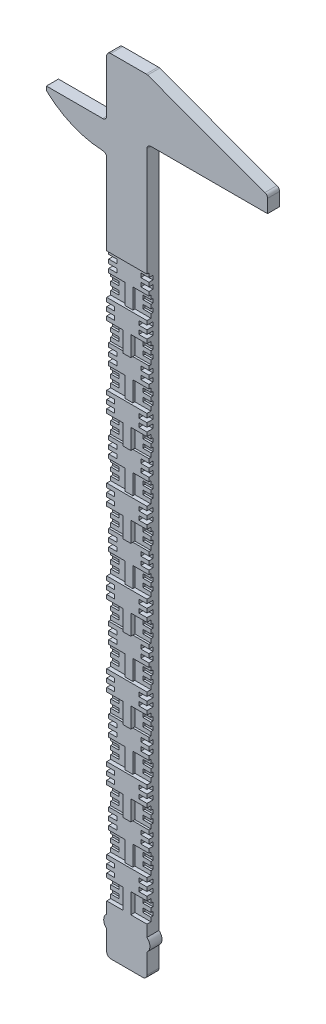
from build123d import *

# Parameters (mm, degrees)
BOSS_EXTRU_1_DEPTH      = 3
ESQUISSE3_W             = 3.5
ESQUISSE3_H             = 10
ENL_V_MAT_EXTRU_2_DEPTH = 10
ESQUISSE4_W             = 5.921927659
ESQUISSE4_H             = 5
ENL_V_MAT_EXTRU_3_DEPTH = 4
ESQUISSE5_W             = 8.496447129
ESQUISSE5_H             = 1
ENL_V_MAT_EXTRU_4_DEPTH = 2


with BuildPart() as part:
    # Esquisse1 → Boss.-Extru.1 (new body)
    with BuildSketch(Plane.XY):
        with BuildLine():
            Line((10.166700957, 14.938876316), (39.344254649, 4.240439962))
            ThreePointArc((39.344254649, 4.240439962), (39.819833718, 3.874165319), (40, 3.301563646))
            Line((40, 3.301563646), (40, 0))
            Line((40, 0), (11, 0))
            ThreePointArc((11, 0), (10.292893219, -0.292893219), (10, -1))
            Line((10, -1), (10, -170.877501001))
            ThreePointArc((10, -170.877501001), (10.75, -172.4387505), (10, -174))
            Line((10, -174), (10, -179))
            ThreePointArc((10, -179), (9.707106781, -179.707106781), (9, -180))
            Line((9, -180), (1, -180))
            ThreePointArc((1, -180), (0.292893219, -179.707106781), (0, -179))
            Line((0, -179), (0, -174))
            ThreePointArc((0, -174), (-0.75, -172.4387505), (0, -170.877501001))
            Line((0, -170.877501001), (0, -7.909897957))
            ThreePointArc((0, -7.909897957), (-0.277640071, -7.218380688), (-0.956392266, -6.910849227))
            ThreePointArc((-0.956392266, -6.910849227), (-8.508004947, -5.214199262), (-15, -1))
            Line((-15, -1), (-15, 0))
            Line((-15, 0), (-1, 0))
            ThreePointArc((-1, 0), (-0.292893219, 0.292893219), (0, 1))
            Line((0, 1), (0, 14))
            ThreePointArc((0, 14), (0.292893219, 14.707106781), (1, 15))
            Line((1, 15), (9.822446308, 15))
            ThreePointArc((9.822446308, 15), (9.997265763, 14.984600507), (10.166700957, 14.938876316))
        make_face()
    extrude(amount=BOSS_EXTRU_1_DEPTH)

    # Esquisse3 → Enl_v. mat.-Extru.2 (cut)
    with BuildSketch(Plane(origin=(10, 0, 0), x_dir=(0, 0, -1), z_dir=(1, 0, 0))):
        with Locations((-4.25, -33.014321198)):
            Rectangle(ESQUISSE3_W, ESQUISSE3_H)
        with Locations((-4.25, -53.014321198)):
            Rectangle(ESQUISSE3_W, ESQUISSE3_H)
        with Locations((-4.25, -73.014321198)):
            Rectangle(ESQUISSE3_W, ESQUISSE3_H)
        with Locations((-4.25, -93.014321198)):
            Rectangle(ESQUISSE3_W, ESQUISSE3_H)
        with Locations((-4.25, -113.014321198)):
            Rectangle(ESQUISSE3_W, ESQUISSE3_H)
        with Locations((-4.25, -133.014321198)):
            Rectangle(ESQUISSE3_W, ESQUISSE3_H)
        with Locations((-4.25, -153.014321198)):
            Rectangle(ESQUISSE3_W, ESQUISSE3_H)
    extrude(amount=-ENL_V_MAT_EXTRU_2_DEPTH, mode=Mode.SUBTRACT)

    # Esquisse4 → Enl_v. mat.-Extru.3 (cut)
    with BuildSketch(Plane(origin=(10, 0, 0), x_dir=(0, 0, -1), z_dir=(1, 0, 0))):
        with Locations((-4.96096383, -35.514321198)):
            Rectangle(ESQUISSE4_W, ESQUISSE4_H)
        with Locations((-4.96096383, -45.514321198)):
            Rectangle(ESQUISSE4_W, ESQUISSE4_H)
        with Locations((-4.96096383, -55.514321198)):
            Rectangle(ESQUISSE4_W, ESQUISSE4_H)
        with Locations((-4.96096383, -65.514321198)):
            Rectangle(ESQUISSE4_W, ESQUISSE4_H)
        with Locations((-4.96096383, -75.514321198)):
            Rectangle(ESQUISSE4_W, ESQUISSE4_H)
        with Locations((-4.96096383, -85.514321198)):
            Rectangle(ESQUISSE4_W, ESQUISSE4_H)
        with Locations((-4.96096383, -95.514321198)):
            Rectangle(ESQUISSE4_W, ESQUISSE4_H)
        with Locations((-4.96096383, -105.514321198)):
            Rectangle(ESQUISSE4_W, ESQUISSE4_H)
        with Locations((-4.96096383, -115.514321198)):
            Rectangle(ESQUISSE4_W, ESQUISSE4_H)
        with Locations((-4.96096383, -125.514321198)):
            Rectangle(ESQUISSE4_W, ESQUISSE4_H)
        with Locations((-4.96096383, -135.514321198)):
            Rectangle(ESQUISSE4_W, ESQUISSE4_H)
        with Locations((-4.96096383, -145.514321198)):
            Rectangle(ESQUISSE4_W, ESQUISSE4_H)
        with Locations((-4.96096383, -155.514321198)):
            Rectangle(ESQUISSE4_W, ESQUISSE4_H)
        with Locations((-4.96096383, -165.514321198)):
            Rectangle(ESQUISSE4_W, ESQUISSE4_H)
    enl_v_mat_extru_3 = extrude(amount=-ENL_V_MAT_EXTRU_3_DEPTH, mode=Mode.SUBTRACT)

    # Sym_trie1: Enl_v. mat.-Extru.3 across plane
    add(enl_v_mat_extru_3.mirror(Plane.ZY.offset(-5)), mode=Mode.SUBTRACT)

    # Esquisse5 → Enl_v. mat.-Extru.4 (cut)
    with BuildSketch(Plane(origin=(10, 0, 0), x_dir=(0, 0, -1), z_dir=(1, 0, 0))):
        with Locations((-5.748223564, -166.514321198)):
            Rectangle(ESQUISSE5_W, ESQUISSE5_H)
        with Locations((-5.748223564, -164.514321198)):
            Rectangle(ESQUISSE5_W, ESQUISSE5_H)
        with Locations((-5.748223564, -159.514321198)):
            Rectangle(ESQUISSE5_W, ESQUISSE5_H)
        with Locations((-5.748223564, -161.514321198)):
            Rectangle(ESQUISSE5_W, ESQUISSE5_H)
        with Locations((-5.748223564, -154.514321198)):
            Rectangle(ESQUISSE5_W, ESQUISSE5_H)
        with Locations((-5.748223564, -156.514321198)):
            Rectangle(ESQUISSE5_W, ESQUISSE5_H)
        with Locations((-5.748223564, -149.514321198)):
            Rectangle(ESQUISSE5_W, ESQUISSE5_H)
        with Locations((-5.748223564, -151.514321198)):
            Rectangle(ESQUISSE5_W, ESQUISSE5_H)
        with Locations((-5.748223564, -144.514321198)):
            Rectangle(ESQUISSE5_W, ESQUISSE5_H)
        with Locations((-5.748223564, -146.514321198)):
            Rectangle(ESQUISSE5_W, ESQUISSE5_H)
        with Locations((-5.748223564, -139.514321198)):
            Rectangle(ESQUISSE5_W, ESQUISSE5_H)
        with Locations((-5.748223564, -141.514321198)):
            Rectangle(ESQUISSE5_W, ESQUISSE5_H)
        with Locations((-5.748223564, -134.514321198)):
            Rectangle(ESQUISSE5_W, ESQUISSE5_H)
        with Locations((-5.748223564, -136.514321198)):
            Rectangle(ESQUISSE5_W, ESQUISSE5_H)
        with Locations((-5.748223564, -129.514321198)):
            Rectangle(ESQUISSE5_W, ESQUISSE5_H)
        with Locations((-5.748223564, -131.514321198)):
            Rectangle(ESQUISSE5_W, ESQUISSE5_H)
        with Locations((-5.748223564, -124.514321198)):
            Rectangle(ESQUISSE5_W, ESQUISSE5_H)
        with Locations((-5.748223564, -126.514321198)):
            Rectangle(ESQUISSE5_W, ESQUISSE5_H)
        with Locations((-5.748223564, -119.514321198)):
            Rectangle(ESQUISSE5_W, ESQUISSE5_H)
        with Locations((-5.748223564, -121.514321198)):
            Rectangle(ESQUISSE5_W, ESQUISSE5_H)
        with Locations((-5.748223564, -114.514321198)):
            Rectangle(ESQUISSE5_W, ESQUISSE5_H)
        with Locations((-5.748223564, -116.514321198)):
            Rectangle(ESQUISSE5_W, ESQUISSE5_H)
        with Locations((-5.748223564, -109.514321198)):
            Rectangle(ESQUISSE5_W, ESQUISSE5_H)
        with Locations((-5.748223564, -111.514321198)):
            Rectangle(ESQUISSE5_W, ESQUISSE5_H)
        with Locations((-5.748223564, -104.514321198)):
            Rectangle(ESQUISSE5_W, ESQUISSE5_H)
        with Locations((-5.748223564, -106.514321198)):
            Rectangle(ESQUISSE5_W, ESQUISSE5_H)
        with Locations((-5.748223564, -99.514321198)):
            Rectangle(ESQUISSE5_W, ESQUISSE5_H)
        with Locations((-5.748223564, -101.514321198)):
            Rectangle(ESQUISSE5_W, ESQUISSE5_H)
        with Locations((-5.748223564, -94.514321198)):
            Rectangle(ESQUISSE5_W, ESQUISSE5_H)
        with Locations((-5.748223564, -96.514321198)):
            Rectangle(ESQUISSE5_W, ESQUISSE5_H)
        with Locations((-5.748223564, -89.514321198)):
            Rectangle(ESQUISSE5_W, ESQUISSE5_H)
        with Locations((-5.748223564, -91.514321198)):
            Rectangle(ESQUISSE5_W, ESQUISSE5_H)
        with Locations((-5.748223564, -84.514321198)):
            Rectangle(ESQUISSE5_W, ESQUISSE5_H)
        with Locations((-5.748223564, -86.514321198)):
            Rectangle(ESQUISSE5_W, ESQUISSE5_H)
        with Locations((-5.748223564, -79.514321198)):
            Rectangle(ESQUISSE5_W, ESQUISSE5_H)
        with Locations((-5.748223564, -81.514321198)):
            Rectangle(ESQUISSE5_W, ESQUISSE5_H)
        with Locations((-5.748223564, -74.514321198)):
            Rectangle(ESQUISSE5_W, ESQUISSE5_H)
        with Locations((-5.748223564, -76.514321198)):
            Rectangle(ESQUISSE5_W, ESQUISSE5_H)
        with Locations((-5.748223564, -69.514321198)):
            Rectangle(ESQUISSE5_W, ESQUISSE5_H)
        with Locations((-5.748223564, -71.514321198)):
            Rectangle(ESQUISSE5_W, ESQUISSE5_H)
        with Locations((-5.748223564, -64.514321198)):
            Rectangle(ESQUISSE5_W, ESQUISSE5_H)
        with Locations((-5.748223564, -66.514321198)):
            Rectangle(ESQUISSE5_W, ESQUISSE5_H)
        with Locations((-5.748223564, -59.514321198)):
            Rectangle(ESQUISSE5_W, ESQUISSE5_H)
        with Locations((-5.748223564, -61.514321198)):
            Rectangle(ESQUISSE5_W, ESQUISSE5_H)
        with Locations((-5.748223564, -54.514321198)):
            Rectangle(ESQUISSE5_W, ESQUISSE5_H)
        with Locations((-5.748223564, -56.514321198)):
            Rectangle(ESQUISSE5_W, ESQUISSE5_H)
        with Locations((-5.748223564, -49.514321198)):
            Rectangle(ESQUISSE5_W, ESQUISSE5_H)
        with Locations((-5.748223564, -51.514321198)):
            Rectangle(ESQUISSE5_W, ESQUISSE5_H)
        with Locations((-5.748223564, -44.514321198)):
            Rectangle(ESQUISSE5_W, ESQUISSE5_H)
        with Locations((-5.748223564, -46.514321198)):
            Rectangle(ESQUISSE5_W, ESQUISSE5_H)
        with Locations((-5.748223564, -39.514321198)):
            Rectangle(ESQUISSE5_W, ESQUISSE5_H)
        with Locations((-5.748223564, -41.514321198)):
            Rectangle(ESQUISSE5_W, ESQUISSE5_H)
        with Locations((-5.748223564, -34.514321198)):
            Rectangle(ESQUISSE5_W, ESQUISSE5_H)
        with Locations((-5.748223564, -36.514321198)):
            Rectangle(ESQUISSE5_W, ESQUISSE5_H)
        with Locations((-5.748223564, -29.514321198)):
            Rectangle(ESQUISSE5_W, ESQUISSE5_H)
        with Locations((-5.748223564, -31.514321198)):
            Rectangle(ESQUISSE5_W, ESQUISSE5_H)
    enl_v_mat_extru_4 = extrude(amount=-ENL_V_MAT_EXTRU_4_DEPTH, mode=Mode.SUBTRACT)

    # Sym_trie2: Enl_v. mat.-Extru.4 across plane
    add(enl_v_mat_extru_4.mirror(Plane.ZY.offset(-5)), mode=Mode.SUBTRACT)


solid = part.part
